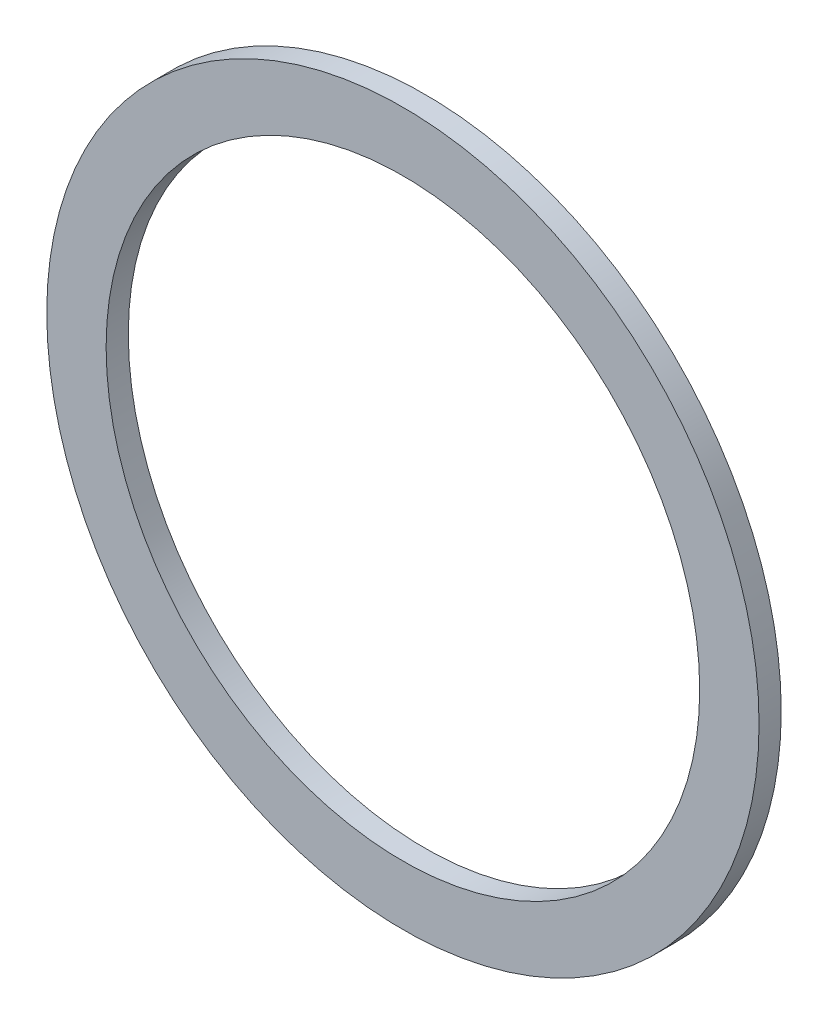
ISO-10303-21;
HEADER;
FILE_DESCRIPTION(('STEP AP214'),'2;1');
FILE_NAME('part.step','',(''),(''),'','','');
FILE_SCHEMA(('AUTOMOTIVE_DESIGN { 1 0 10303 214 1 1 1 1 }'));
ENDSEC;
DATA;
#1=APPLICATION_CONTEXT('core data for automotive mechanical design processes');
#2=APPLICATION_PROTOCOL_DEFINITION('international standard','automotive_design',2000,#1);
#3=PRODUCT_CONTEXT('',#1,'mechanical');
#4=PRODUCT('Part','Part','',(#3));
#5=PRODUCT_RELATED_PRODUCT_CATEGORY('part','',(#4));
#6=PRODUCT_DEFINITION_FORMATION('','',#4);
#7=PRODUCT_DEFINITION_CONTEXT('part definition',#1,'design');
#8=PRODUCT_DEFINITION('design','',#6,#7);
#9=PRODUCT_DEFINITION_SHAPE('','',#8);
#10=(LENGTH_UNIT() NAMED_UNIT(*) SI_UNIT(.MILLI.,.METRE.));
#11=(NAMED_UNIT(*) PLANE_ANGLE_UNIT() SI_UNIT($,.RADIAN.));
#12=(NAMED_UNIT(*) SI_UNIT($,.STERADIAN.) SOLID_ANGLE_UNIT());
#13=UNCERTAINTY_MEASURE_WITH_UNIT(LENGTH_MEASURE(1.E-05),#10,'distance_accuracy_value','');
#14=(GEOMETRIC_REPRESENTATION_CONTEXT(3) GLOBAL_UNCERTAINTY_ASSIGNED_CONTEXT((#13)) GLOBAL_UNIT_ASSIGNED_CONTEXT((#10,
#11,#12)) REPRESENTATION_CONTEXT('',''));
#15=CARTESIAN_POINT('',(0.,0.,0.));
#16=DIRECTION('',(0.,0.,1.));
#17=DIRECTION('',(1.,0.,0.));
#18=AXIS2_PLACEMENT_3D('',#15,#16,#17);
#19=CARTESIAN_POINT('',(0.,0.,0.7874));
#20=DIRECTION('',(0.,0.,1.));
#21=DIRECTION('',(1.,0.,0.));
#22=AXIS2_PLACEMENT_3D('',#19,#20,#21);
#23=PLANE('',#22);
#24=CARTESIAN_POINT('',(0.,0.,0.7874));
#25=DIRECTION('',(0.,0.,1.));
#26=DIRECTION('',(1.,0.,0.));
#27=AXIS2_PLACEMENT_3D('',#24,#25,#26);
#28=CIRCLE('',#27,12.6492);
#29=CARTESIAN_POINT('',(12.6492,0.,0.7874));
#30=VERTEX_POINT('',#29);
#31=EDGE_CURVE('E10',#30,#30,#28,.T.);
#32=ORIENTED_EDGE('',*,*,#31,.T.);
#33=EDGE_LOOP('',(#32));
#34=FACE_BOUND('',#33,.T.);
#35=CARTESIAN_POINT('',(0.,0.,0.7874));
#36=DIRECTION('',(0.,0.,1.));
#37=DIRECTION('',(1.,0.,0.));
#38=AXIS2_PLACEMENT_3D('',#35,#36,#37);
#39=CIRCLE('',#38,10.541);
#40=CARTESIAN_POINT('',(10.541,0.,0.7874));
#41=VERTEX_POINT('',#40);
#42=EDGE_CURVE('E39',#41,#41,#39,.T.);
#43=ORIENTED_EDGE('',*,*,#42,.F.);
#44=EDGE_LOOP('',(#43));
#45=FACE_BOUND('',#44,.T.);
#46=ADVANCED_FACE('F28',(#34,#45),#23,.T.);
#47=CARTESIAN_POINT('',(0.,0.,0.));
#48=DIRECTION('',(0.,0.,1.));
#49=DIRECTION('',(1.,0.,0.));
#50=AXIS2_PLACEMENT_3D('',#47,#48,#49);
#51=PLANE('',#50);
#52=CARTESIAN_POINT('',(0.,0.,0.));
#53=DIRECTION('',(0.,0.,1.));
#54=DIRECTION('',(1.,0.,0.));
#55=AXIS2_PLACEMENT_3D('',#52,#53,#54);
#56=CIRCLE('',#55,12.6492);
#57=CARTESIAN_POINT('',(12.6492,0.,0.));
#58=VERTEX_POINT('',#57);
#59=EDGE_CURVE('E35',#58,#58,#56,.T.);
#60=ORIENTED_EDGE('',*,*,#59,.F.);
#61=EDGE_LOOP('',(#60));
#62=FACE_BOUND('',#61,.T.);
#63=CARTESIAN_POINT('',(0.,0.,0.));
#64=DIRECTION('',(0.,0.,1.));
#65=DIRECTION('',(1.,0.,0.));
#66=AXIS2_PLACEMENT_3D('',#63,#64,#65);
#67=CIRCLE('',#66,10.541);
#68=CARTESIAN_POINT('',(10.541,0.,0.));
#69=VERTEX_POINT('',#68);
#70=EDGE_CURVE('E43',#69,#69,#67,.T.);
#71=ORIENTED_EDGE('',*,*,#70,.T.);
#72=EDGE_LOOP('',(#71));
#73=FACE_BOUND('',#72,.T.);
#74=ADVANCED_FACE('F49',(#62,#73),#51,.F.);
#75=CARTESIAN_POINT('',(0.,0.,0.7874));
#76=DIRECTION('',(0.,0.,-1.));
#77=DIRECTION('',(-1.,0.,0.));
#78=AXIS2_PLACEMENT_3D('',#75,#76,#77);
#79=CYLINDRICAL_SURFACE('',#78,12.6492);
#80=ORIENTED_EDGE('',*,*,#31,.F.);
#81=EDGE_LOOP('',(#80));
#82=FACE_BOUND('',#81,.T.);
#83=ORIENTED_EDGE('',*,*,#59,.T.);
#84=EDGE_LOOP('',(#83));
#85=FACE_BOUND('',#84,.T.);
#86=ADVANCED_FACE('F30',(#82,#85),#79,.T.);
#87=CARTESIAN_POINT('',(0.,0.,0.7874));
#88=DIRECTION('',(0.,0.,-1.));
#89=DIRECTION('',(-1.,0.,0.));
#90=AXIS2_PLACEMENT_3D('',#87,#88,#89);
#91=CYLINDRICAL_SURFACE('',#90,10.541);
#92=ORIENTED_EDGE('',*,*,#42,.T.);
#93=EDGE_LOOP('',(#92));
#94=FACE_BOUND('',#93,.T.);
#95=ORIENTED_EDGE('',*,*,#70,.F.);
#96=EDGE_LOOP('',(#95));
#97=FACE_BOUND('',#96,.T.);
#98=ADVANCED_FACE('F51',(#94,#97),#91,.F.);
#99=CLOSED_SHELL('',(#46,#74,#86,#98));
#100=MANIFOLD_SOLID_BREP('B2',#99);
#101=ADVANCED_BREP_SHAPE_REPRESENTATION('',(#18,#100),#14);
#102=SHAPE_DEFINITION_REPRESENTATION(#9,#101);
ENDSEC;
END-ISO-10303-21;
